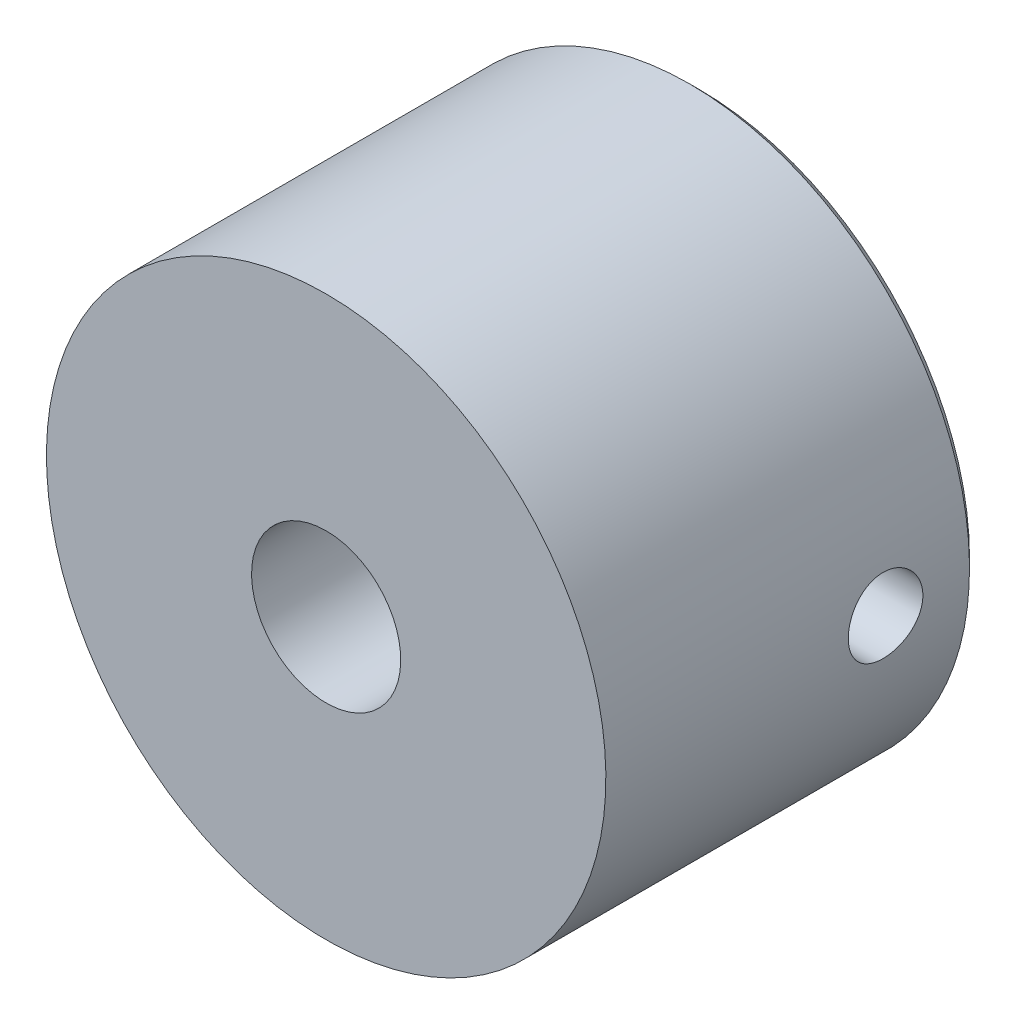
ISO-10303-21;
HEADER;
FILE_DESCRIPTION(('STEP AP214'),'2;1');
FILE_NAME('part.step','',(''),(''),'','','');
FILE_SCHEMA(('AUTOMOTIVE_DESIGN { 1 0 10303 214 1 1 1 1 }'));
ENDSEC;
DATA;
#1=APPLICATION_CONTEXT('core data for automotive mechanical design processes');
#2=APPLICATION_PROTOCOL_DEFINITION('international standard','automotive_design',2000,#1);
#3=PRODUCT_CONTEXT('',#1,'mechanical');
#4=PRODUCT('Part','Part','',(#3));
#5=PRODUCT_RELATED_PRODUCT_CATEGORY('part','',(#4));
#6=PRODUCT_DEFINITION_FORMATION('','',#4);
#7=PRODUCT_DEFINITION_CONTEXT('part definition',#1,'design');
#8=PRODUCT_DEFINITION('design','',#6,#7);
#9=PRODUCT_DEFINITION_SHAPE('','',#8);
#10=(LENGTH_UNIT() NAMED_UNIT(*) SI_UNIT(.MILLI.,.METRE.));
#11=(NAMED_UNIT(*) PLANE_ANGLE_UNIT() SI_UNIT($,.RADIAN.));
#12=(NAMED_UNIT(*) SI_UNIT($,.STERADIAN.) SOLID_ANGLE_UNIT());
#13=UNCERTAINTY_MEASURE_WITH_UNIT(LENGTH_MEASURE(1.E-05),#10,'distance_accuracy_value','');
#14=(GEOMETRIC_REPRESENTATION_CONTEXT(3) GLOBAL_UNCERTAINTY_ASSIGNED_CONTEXT((#13)) GLOBAL_UNIT_ASSIGNED_CONTEXT((#10,
#11,#12)) REPRESENTATION_CONTEXT('',''));
#15=CARTESIAN_POINT('',(0.,0.,0.));
#16=DIRECTION('',(0.,0.,1.));
#17=DIRECTION('',(1.,0.,0.));
#18=AXIS2_PLACEMENT_3D('',#15,#16,#17);
#19=CARTESIAN_POINT('',(0.,0.,20.));
#20=DIRECTION('',(0.,0.,1.));
#21=DIRECTION('',(0.,1.,0.));
#22=AXIS2_PLACEMENT_3D('',#19,#20,#21);
#23=PLANE('',#22);
#24=CARTESIAN_POINT('',(0.,0.,20.));
#25=DIRECTION('',(0.,0.,1.));
#26=DIRECTION('',(0.,1.,0.));
#27=AXIS2_PLACEMENT_3D('',#24,#25,#26);
#28=CIRCLE('',#27,15.);
#29=CARTESIAN_POINT('',(0.,15.,20.));
#30=VERTEX_POINT('',#29);
#31=EDGE_CURVE('E23',#30,#30,#28,.T.);
#32=ORIENTED_EDGE('',*,*,#31,.T.);
#33=EDGE_LOOP('',(#32));
#34=FACE_BOUND('',#33,.T.);
#35=CARTESIAN_POINT('',(0.,0.,20.));
#36=DIRECTION('',(0.,0.,1.));
#37=DIRECTION('',(0.,1.,0.));
#38=AXIS2_PLACEMENT_3D('',#35,#36,#37);
#39=CIRCLE('',#38,4.);
#40=CARTESIAN_POINT('',(0.,4.,20.));
#41=VERTEX_POINT('',#40);
#42=EDGE_CURVE('E27',#41,#41,#39,.T.);
#43=ORIENTED_EDGE('',*,*,#42,.F.);
#44=EDGE_LOOP('',(#43));
#45=FACE_BOUND('',#44,.T.);
#46=ADVANCED_FACE('F12',(#34,#45),#23,.T.);
#47=CARTESIAN_POINT('',(0.,0.,0.));
#48=DIRECTION('',(0.,0.,1.));
#49=DIRECTION('',(0.,1.,0.));
#50=AXIS2_PLACEMENT_3D('',#47,#48,#49);
#51=PLANE('',#50);
#52=CARTESIAN_POINT('',(0.,0.,0.));
#53=DIRECTION('',(0.,0.,1.));
#54=DIRECTION('',(0.,1.,0.));
#55=AXIS2_PLACEMENT_3D('',#52,#53,#54);
#56=CIRCLE('',#55,14.5);
#57=CARTESIAN_POINT('',(0.,14.5,0.));
#58=VERTEX_POINT('',#57);
#59=EDGE_CURVE('E8',#58,#58,#56,.F.);
#60=ORIENTED_EDGE('',*,*,#59,.T.);
#61=EDGE_LOOP('',(#60));
#62=FACE_BOUND('',#61,.T.);
#63=CARTESIAN_POINT('',(0.,0.,0.));
#64=DIRECTION('',(0.,0.,1.));
#65=DIRECTION('',(0.,1.,0.));
#66=AXIS2_PLACEMENT_3D('',#63,#64,#65);
#67=CIRCLE('',#66,4.);
#68=CARTESIAN_POINT('',(0.,4.,0.));
#69=VERTEX_POINT('',#68);
#70=EDGE_CURVE('E32',#69,#69,#67,.T.);
#71=ORIENTED_EDGE('',*,*,#70,.T.);
#72=EDGE_LOOP('',(#71));
#73=FACE_BOUND('',#72,.T.);
#74=ADVANCED_FACE('F64',(#62,#73),#51,.F.);
#75=CARTESIAN_POINT('',(0.,0.,20.));
#76=DIRECTION('',(0.,0.,-1.));
#77=DIRECTION('',(0.,-1.,0.));
#78=AXIS2_PLACEMENT_3D('',#75,#76,#77);
#79=CYLINDRICAL_SURFACE('',#78,15.);
#80=CARTESIAN_POINT('',(15.,0.,7.));
#81=CARTESIAN_POINT('',(14.9999983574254,-0.111808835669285,6.99999529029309));
#82=CARTESIAN_POINT('',(14.9987367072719,-0.223685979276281,6.99059246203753));
#83=CARTESIAN_POINT('',(14.993825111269,-0.444322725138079,6.95323365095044));
#84=CARTESIAN_POINT('',(14.9901727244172,-0.553079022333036,6.92525870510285));
#85=CARTESIAN_POINT('',(14.9808907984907,-0.764248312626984,6.85159828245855));
#86=CARTESIAN_POINT('',(14.9752626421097,-0.866665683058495,6.80592518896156));
#87=CARTESIAN_POINT('',(14.9626538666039,-1.0623638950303,6.69819308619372));
#88=CARTESIAN_POINT('',(14.9556734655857,-1.15564620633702,6.63613671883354));
#89=CARTESIAN_POINT('',(14.9410899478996,-1.33102582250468,6.49698673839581));
#90=CARTESIAN_POINT('',(14.9334835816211,-1.41305798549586,6.41981135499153));
#91=CARTESIAN_POINT('',(14.9185313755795,-1.56304735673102,6.25278981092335));
#92=CARTESIAN_POINT('',(14.9111855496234,-1.63100381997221,6.16294298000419));
#93=CARTESIAN_POINT('',(14.8975543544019,-1.75115902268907,5.97270087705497));
#94=CARTESIAN_POINT('',(14.8912731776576,-1.80329607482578,5.87226631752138));
#95=CARTESIAN_POINT('',(14.8805258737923,-1.8899384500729,5.66396893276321));
#96=CARTESIAN_POINT('',(14.8760596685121,-1.92444453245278,5.55610642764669));
#97=CARTESIAN_POINT('',(14.8694793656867,-1.97464606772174,5.33669418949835));
#98=CARTESIAN_POINT('',(14.8673514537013,-1.99045204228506,5.22517016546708));
#99=CARTESIAN_POINT('',(14.8656465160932,-2.00314680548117,5.00103382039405));
#100=CARTESIAN_POINT('',(14.866069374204,-2.00003645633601,4.8884215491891));
#101=CARTESIAN_POINT('',(14.8694055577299,-1.97507745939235,4.66607886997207));
#102=CARTESIAN_POINT('',(14.8723026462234,-1.95335097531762,4.5563344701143));
#103=CARTESIAN_POINT('',(14.8802355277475,-1.89196724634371,4.34206316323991));
#104=CARTESIAN_POINT('',(14.8852713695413,-1.85230959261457,4.23753637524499));
#105=CARTESIAN_POINT('',(14.8969326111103,-1.75605929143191,4.0362903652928));
#106=CARTESIAN_POINT('',(14.903562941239,-1.69941397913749,3.93959662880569));
#107=CARTESIAN_POINT('',(14.9176623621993,-1.57083393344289,3.75704091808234));
#108=CARTESIAN_POINT('',(14.9251314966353,-1.49889840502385,3.67117950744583));
#109=CARTESIAN_POINT('',(14.9401389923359,-1.34110490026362,3.5120169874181));
#110=CARTESIAN_POINT('',(14.947677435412,-1.25514170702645,3.43882015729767));
#111=CARTESIAN_POINT('',(14.9619192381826,-1.07209417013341,3.30787795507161));
#112=CARTESIAN_POINT('',(14.9686225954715,-0.975009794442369,3.25013262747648));
#113=CARTESIAN_POINT('',(14.9804439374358,-0.77239221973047,3.15173088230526));
#114=CARTESIAN_POINT('',(14.9855612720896,-0.666855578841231,3.11108146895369));
#115=CARTESIAN_POINT('',(14.9936282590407,-0.450370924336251,3.04811068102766));
#116=CARTESIAN_POINT('',(14.9965780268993,-0.339423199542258,3.02578832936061));
#117=CARTESIAN_POINT('',(14.9999624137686,-0.116166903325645,3.00024156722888));
#118=CARTESIAN_POINT('',(15.0004159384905,-0.00387503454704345,2.99687359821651));
#119=CARTESIAN_POINT('',(14.9988079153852,0.219671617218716,3.00895166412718));
#120=CARTESIAN_POINT('',(14.996746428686,0.330926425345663,3.02439724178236));
#121=CARTESIAN_POINT('',(14.990351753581,0.548813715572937,3.07354465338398));
#122=CARTESIAN_POINT('',(14.9860271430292,0.655462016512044,3.10717756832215));
#123=CARTESIAN_POINT('',(14.9755900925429,0.861605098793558,3.19167296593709));
#124=CARTESIAN_POINT('',(14.9694775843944,0.961099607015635,3.24253610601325));
#125=CARTESIAN_POINT('',(14.9560983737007,1.15074887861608,3.36039215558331));
#126=CARTESIAN_POINT('',(14.9488251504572,1.2408458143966,3.42747736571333));
#127=CARTESIAN_POINT('',(14.9339572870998,1.4085529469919,3.57574332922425));
#128=CARTESIAN_POINT('',(14.9263626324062,1.48616257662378,3.65692472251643));
#129=CARTESIAN_POINT('',(14.9116490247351,1.62720549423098,3.83171314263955));
#130=CARTESIAN_POINT('',(14.904533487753,1.69054327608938,3.92539756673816));
#131=CARTESIAN_POINT('',(14.8916413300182,1.80058351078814,4.12215941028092));
#132=CARTESIAN_POINT('',(14.8858646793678,1.84728633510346,4.22523661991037));
#133=CARTESIAN_POINT('',(14.8763281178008,1.92257836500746,4.43755724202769));
#134=CARTESIAN_POINT('',(14.872562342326,1.95122028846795,4.5467816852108));
#135=CARTESIAN_POINT('',(14.8674574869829,1.98974667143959,4.76854363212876));
#136=CARTESIAN_POINT('',(14.8661182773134,1.99963213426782,4.88108095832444));
#137=CARTESIAN_POINT('',(14.8660223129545,2.00034485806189,5.10532349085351));
#138=CARTESIAN_POINT('',(14.8672452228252,1.99132219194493,5.21702824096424));
#139=CARTESIAN_POINT('',(14.872091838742,1.95479376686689,5.43731787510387));
#140=CARTESIAN_POINT('',(14.8757155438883,1.92728801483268,5.54590276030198));
#141=CARTESIAN_POINT('',(14.8849489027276,1.85462310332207,5.75684368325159));
#142=CARTESIAN_POINT('',(14.890557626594,1.80947220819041,5.85920261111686));
#143=CARTESIAN_POINT('',(14.9031304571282,1.70281342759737,6.05491588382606));
#144=CARTESIAN_POINT('',(14.910094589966,1.64130522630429,6.14827005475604));
#145=CARTESIAN_POINT('',(14.9246596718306,1.50312448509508,6.32408964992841));
#146=CARTESIAN_POINT('',(14.9322650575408,1.42634027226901,6.40646694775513));
#147=CARTESIAN_POINT('',(14.9472171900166,1.26002169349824,6.55722321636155));
#148=CARTESIAN_POINT('',(14.9545638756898,1.17048434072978,6.62559889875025));
#149=CARTESIAN_POINT('',(14.9682063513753,0.980752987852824,6.74666713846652));
#150=CARTESIAN_POINT('',(14.9744974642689,0.880514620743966,6.79929066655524));
#151=CARTESIAN_POINT('',(14.9852732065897,0.672592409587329,6.88688059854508));
#152=CARTESIAN_POINT('',(14.9897597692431,0.564916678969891,6.92186590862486));
#153=CARTESIAN_POINT('',(14.9953572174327,0.38058840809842,6.96494800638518));
#154=CARTESIAN_POINT('',(14.9970896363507,0.30509108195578,6.97807324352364));
#155=CARTESIAN_POINT('',(14.9994115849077,0.153073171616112,6.99560081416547));
#156=CARTESIAN_POINT('',(15.000001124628,0.0765525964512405,7.0000032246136));
#157=CARTESIAN_POINT('',(15.,0.,7.));
#158=B_SPLINE_CURVE_WITH_KNOTS('',3,(#80,#81,#82,#83,#84,#85,#86,#87,#88,#89,#90,#91,#92,#93,
#94,#95,#96,#97,#98,#99,#100,#101,#102,#103,#104,#105,#106,#107,#108,#109,#110,#111,#112,#113,
#114,#115,#116,#117,#118,#119,#120,#121,#122,#123,#124,#125,#126,#127,#128,#129,#130,#131,#132,
#133,#134,#135,#136,#137,#138,#139,#140,#141,#142,#143,#144,#145,#146,#147,#148,#149,#150,#151,
#152,#153,#154,#155,#156,#157),.UNSPECIFIED.,.T.,.F.,(4,2,2,2,2,2,2,2,2,2,2,2,2,2,2,2,2,2,2,2,2,
2,2,2,2,2,2,2,2,2,2,2,2,2,2,2,2,2,4),(0.,0.335146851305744,0.670636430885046,1.00589169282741,
1.34109292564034,1.67815978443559,2.01524447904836,2.35362721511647,2.69199537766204,
3.02835355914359,3.3646964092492,3.69884885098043,4.0330089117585,4.36821583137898,
4.70344018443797,5.04130544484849,5.37917167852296,5.71717620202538,6.05516270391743,
6.3905858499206,6.72600084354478,7.06015363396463,7.39431917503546,7.73043274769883,
8.06656158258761,8.40487704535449,8.74318495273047,9.08050074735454,9.41779849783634,
9.75242927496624,10.0870599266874,10.4215340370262,10.756014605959,11.0930366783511,
11.4301378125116,11.7686952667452,12.1068890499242,12.3363573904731,12.5658237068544),.UNSPECIFIED.);
#159=CARTESIAN_POINT('',(15.,0.,7.));
#160=VERTEX_POINT('',#159);
#161=EDGE_CURVE('E35',#160,#160,#158,.T.);
#162=ORIENTED_EDGE('',*,*,#161,.F.);
#163=EDGE_LOOP('',(#162));
#164=FACE_BOUND('',#163,.T.);
#165=CARTESIAN_POINT('',(0.,0.,0.5));
#166=DIRECTION('',(0.,0.,1.));
#167=DIRECTION('',(0.,1.,0.));
#168=AXIS2_PLACEMENT_3D('',#165,#166,#167);
#169=CIRCLE('',#168,15.);
#170=CARTESIAN_POINT('',(0.,15.,0.5));
#171=VERTEX_POINT('',#170);
#172=EDGE_CURVE('E19',#171,#171,#169,.T.);
#173=ORIENTED_EDGE('',*,*,#172,.T.);
#174=EDGE_LOOP('',(#173));
#175=FACE_BOUND('',#174,.T.);
#176=ORIENTED_EDGE('',*,*,#31,.F.);
#177=EDGE_LOOP('',(#176));
#178=FACE_BOUND('',#177,.T.);
#179=ADVANCED_FACE('F14',(#164,#175,#178),#79,.T.);
#180=CARTESIAN_POINT('',(0.,0.,20.));
#181=DIRECTION('',(0.,0.,-1.));
#182=DIRECTION('',(0.,-1.,0.));
#183=AXIS2_PLACEMENT_3D('',#180,#181,#182);
#184=CYLINDRICAL_SURFACE('',#183,4.);
#185=CARTESIAN_POINT('',(4.,0.,7.));
#186=CARTESIAN_POINT('',(3.99999426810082,-0.105143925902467,6.99999339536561));
#187=CARTESIAN_POINT('',(3.99580982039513,-0.210413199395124,6.99165985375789));
#188=CARTESIAN_POINT('',(3.97948312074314,-0.417840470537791,6.95869423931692));
#189=CARTESIAN_POINT('',(3.9673257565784,-0.519992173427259,6.93403121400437));
#190=CARTESIAN_POINT('',(3.93632558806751,-0.717867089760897,6.86961238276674));
#191=CARTESIAN_POINT('',(3.91750878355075,-0.813613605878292,6.82991523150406));
#192=CARTESIAN_POINT('',(3.87491553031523,-0.996945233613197,6.73685875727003));
#193=CARTESIAN_POINT('',(3.85113947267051,-1.08453098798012,6.68350051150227));
#194=CARTESIAN_POINT('',(3.79912516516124,-1.25501563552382,6.56096550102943));
#195=CARTESIAN_POINT('',(3.77070398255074,-1.33731042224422,6.49102704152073));
#196=CARTESIAN_POINT('',(3.71319940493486,-1.48955888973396,6.33895704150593));
#197=CARTESIAN_POINT('',(3.6841155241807,-1.55950316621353,6.25681629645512));
#198=CARTESIAN_POINT('',(3.62597902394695,-1.69050400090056,6.07503330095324));
#199=CARTESIAN_POINT('',(3.59710373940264,-1.75045067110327,5.97452780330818));
#200=CARTESIAN_POINT('',(3.54571957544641,-1.85233645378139,5.76326532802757));
#201=CARTESIAN_POINT('',(3.5232061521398,-1.89428842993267,5.6525157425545));
#202=CARTESIAN_POINT('',(3.48915734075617,-1.95626488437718,5.43066978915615));
#203=CARTESIAN_POINT('',(3.47704543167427,-1.97745171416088,5.31999109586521));
#204=CARTESIAN_POINT('',(3.46363779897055,-2.00085398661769,5.09604232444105));
#205=CARTESIAN_POINT('',(3.46233138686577,-2.00308817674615,4.98277491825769));
#206=CARTESIAN_POINT('',(3.47021860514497,-1.98937457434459,4.77142795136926));
#207=CARTESIAN_POINT('',(3.47817527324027,-1.97556911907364,4.6731519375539));
#208=CARTESIAN_POINT('',(3.50152457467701,-1.93387969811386,4.48055618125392));
#209=CARTESIAN_POINT('',(3.51691957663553,-1.9059912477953,4.38623770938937));
#210=CARTESIAN_POINT('',(3.55374952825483,-1.83641956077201,4.20154173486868));
#211=CARTESIAN_POINT('',(3.57531681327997,-1.79443013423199,4.11130720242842));
#212=CARTESIAN_POINT('',(3.62206808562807,-1.698083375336,3.93873141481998));
#213=CARTESIAN_POINT('',(3.64725369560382,-1.64372048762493,3.85639372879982));
#214=CARTESIAN_POINT('',(3.70226315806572,-1.51613210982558,3.69095749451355));
#215=CARTESIAN_POINT('',(3.73227020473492,-1.44138891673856,3.60908625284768));
#216=CARTESIAN_POINT('',(3.79095246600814,-1.27911115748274,3.4585291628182));
#217=CARTESIAN_POINT('',(3.81962703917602,-1.19157051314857,3.38984961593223));
#218=CARTESIAN_POINT('',(3.87403974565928,-1.00103301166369,3.26462867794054));
#219=CARTESIAN_POINT('',(3.89957968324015,-0.897507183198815,3.20879905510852));
#220=CARTESIAN_POINT('',(3.94315762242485,-0.680932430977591,3.11580594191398));
#221=CARTESIAN_POINT('',(3.96120157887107,-0.56789115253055,3.07862762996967));
#222=CARTESIAN_POINT('',(3.98648667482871,-0.345532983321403,3.02704919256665));
#223=CARTESIAN_POINT('',(3.9944987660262,-0.236683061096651,3.01101752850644));
#224=CARTESIAN_POINT('',(4.00146026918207,-0.0175591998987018,2.99707053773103));
#225=CARTESIAN_POINT('',(4.00041397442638,0.0927140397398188,2.99914662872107));
#226=CARTESIAN_POINT('',(3.9898238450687,0.302465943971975,3.02041337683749));
#227=CARTESIAN_POINT('',(3.98094491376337,0.402118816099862,3.03826506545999));
#228=CARTESIAN_POINT('',(3.9564434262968,0.596813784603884,3.08847614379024));
#229=CARTESIAN_POINT('',(3.94082012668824,0.691855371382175,3.12083713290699));
#230=CARTESIAN_POINT('',(3.90368502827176,0.877777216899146,3.19999693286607));
#231=CARTESIAN_POINT('',(3.88201763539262,0.968460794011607,3.24718210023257));
#232=CARTESIAN_POINT('',(3.83487948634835,1.14092272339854,3.35421507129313));
#233=CARTESIAN_POINT('',(3.80940711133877,1.22269725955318,3.41406826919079));
#234=CARTESIAN_POINT('',(3.75416442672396,1.38353537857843,3.55152085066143));
#235=CARTESIAN_POINT('',(3.72421769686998,1.46154415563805,3.63028573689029));
#236=CARTESIAN_POINT('',(3.6652478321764,1.60371264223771,3.79985030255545));
#237=CARTESIAN_POINT('',(3.63622534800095,1.66786277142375,3.89065823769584));
#238=CARTESIAN_POINT('',(3.58102384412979,1.78341582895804,4.08728730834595));
#239=CARTESIAN_POINT('',(3.55505059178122,1.8340509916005,4.19362253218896));
#240=CARTESIAN_POINT('',(3.51148144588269,1.91616565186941,4.41502013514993));
#241=CARTESIAN_POINT('',(3.493874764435,1.94766983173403,4.53007105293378));
#242=CARTESIAN_POINT('',(3.47123002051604,1.98772337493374,4.75382044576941));
#243=CARTESIAN_POINT('',(3.4651476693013,1.9981859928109,4.86206850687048));
#244=CARTESIAN_POINT('',(3.46330709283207,2.0013783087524,5.07889413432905));
#245=CARTESIAN_POINT('',(3.4675443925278,1.99411569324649,5.18747153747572));
#246=CARTESIAN_POINT('',(3.48475724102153,1.96385225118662,5.39096700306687));
#247=CARTESIAN_POINT('',(3.49686188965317,1.94241662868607,5.48620094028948));
#248=CARTESIAN_POINT('',(3.52742032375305,1.88635071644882,5.67161623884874));
#249=CARTESIAN_POINT('',(3.54587615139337,1.85171618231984,5.76179596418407));
#250=CARTESIAN_POINT('',(3.58857060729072,1.76763149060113,5.94124970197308));
#251=CARTESIAN_POINT('',(3.61311444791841,1.7173422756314,6.03005580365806));
#252=CARTESIAN_POINT('',(3.66470663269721,1.60430194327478,6.19854907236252));
#253=CARTESIAN_POINT('',(3.69175627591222,1.54154434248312,6.27823146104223));
#254=CARTESIAN_POINT('',(3.74924646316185,1.39640665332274,6.43628396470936));
#255=CARTESIAN_POINT('',(3.77969966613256,1.31256884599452,6.51331820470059));
#256=CARTESIAN_POINT('',(3.83755504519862,1.13230961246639,6.65252596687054));
#257=CARTESIAN_POINT('',(3.86495557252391,1.03588144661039,6.71469147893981));
#258=CARTESIAN_POINT('',(3.91396019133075,0.83186319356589,6.82247272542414));
#259=CARTESIAN_POINT('',(3.93552192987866,0.72419900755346,6.86796833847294));
#260=CARTESIAN_POINT('',(3.97002682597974,0.501484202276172,6.93961633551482));
#261=CARTESIAN_POINT('',(3.98299446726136,0.386455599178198,6.96582369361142));
#262=CARTESIAN_POINT('',(3.99390923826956,0.225203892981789,6.98779482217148));
#263=CARTESIAN_POINT('',(3.99618730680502,0.180323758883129,6.99236528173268));
#264=CARTESIAN_POINT('',(3.99923393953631,0.0903034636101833,6.99846933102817));
#265=CARTESIAN_POINT('',(4.00000246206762,0.0451632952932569,7.00000283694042));
#266=CARTESIAN_POINT('',(4.,0.,7.));
#267=B_SPLINE_CURVE_WITH_KNOTS('',3,(#185,#186,#187,#188,#189,#190,#191,#192,#193,#194,#195,
#196,#197,#198,#199,#200,#201,#202,#203,#204,#205,#206,#207,#208,#209,#210,#211,#212,#213,#214,
#215,#216,#217,#218,#219,#220,#221,#222,#223,#224,#225,#226,#227,#228,#229,#230,#231,#232,#233,
#234,#235,#236,#237,#238,#239,#240,#241,#242,#243,#244,#245,#246,#247,#248,#249,#250,#251,#252,
#253,#254,#255,#256,#257,#258,#259,#260,#261,#262,#263,#264,#265,#266),.UNSPECIFIED.,.T.,.F.,(4,
2,2,2,2,2,2,2,2,2,2,2,2,2,2,2,2,2,2,2,2,2,2,2,2,2,2,2,2,2,2,2,2,2,2,2,2,2,2,2,4),(0.,
0.315248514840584,0.631096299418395,0.945724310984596,1.26032752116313,1.59396351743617,
1.92785247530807,2.28763452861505,2.64715895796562,2.98516024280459,3.32282714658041,
3.62011424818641,3.91749607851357,4.22180480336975,4.52625042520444,4.86929882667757,
5.21251069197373,5.57166044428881,5.93052433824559,6.25966580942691,6.58865129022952,
6.89213813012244,7.19565843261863,7.50785712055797,7.82018901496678,8.16319221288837,
8.50643177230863,8.86629364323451,9.22569023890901,9.55058615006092,9.87534119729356,
10.1691586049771,10.463070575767,10.7767291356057,11.0905512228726,11.4425048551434,
11.7946476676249,12.1492802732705,12.502898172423,12.6383056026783,12.7737167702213),.UNSPECIFIED.);
#268=CARTESIAN_POINT('',(4.,0.,7.));
#269=VERTEX_POINT('',#268);
#270=EDGE_CURVE('E43',#269,#269,#267,.T.);
#271=ORIENTED_EDGE('',*,*,#270,.T.);
#272=EDGE_LOOP('',(#271));
#273=FACE_BOUND('',#272,.T.);
#274=ORIENTED_EDGE('',*,*,#42,.T.);
#275=EDGE_LOOP('',(#274));
#276=FACE_BOUND('',#275,.T.);
#277=ORIENTED_EDGE('',*,*,#70,.F.);
#278=EDGE_LOOP('',(#277));
#279=FACE_BOUND('',#278,.T.);
#280=ADVANCED_FACE('F59',(#273,#276,#279),#184,.F.);
#281=CARTESIAN_POINT('',(0.,0.,0.5));
#282=DIRECTION('',(0.,0.,1.));
#283=DIRECTION('',(0.,1.,0.));
#284=AXIS2_PLACEMENT_3D('',#281,#282,#283);
#285=CONICAL_SURFACE('',#284,15.,0.785398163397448);
#286=ORIENTED_EDGE('',*,*,#59,.F.);
#287=EDGE_LOOP('',(#286));
#288=FACE_BOUND('',#287,.T.);
#289=ORIENTED_EDGE('',*,*,#172,.F.);
#290=EDGE_LOOP('',(#289));
#291=FACE_BOUND('',#290,.T.);
#292=ADVANCED_FACE('F54',(#288,#291),#285,.T.);
#293=CARTESIAN_POINT('',(15.001,0.,5.));
#294=DIRECTION('',(-1.,0.,0.));
#295=DIRECTION('',(0.,0.,1.));
#296=AXIS2_PLACEMENT_3D('',#293,#294,#295);
#297=CYLINDRICAL_SURFACE('',#296,2.);
#298=ORIENTED_EDGE('',*,*,#270,.F.);
#299=EDGE_LOOP('',(#298));
#300=FACE_BOUND('',#299,.T.);
#301=ORIENTED_EDGE('',*,*,#161,.T.);
#302=EDGE_LOOP('',(#301));
#303=FACE_BOUND('',#302,.T.);
#304=ADVANCED_FACE('F48',(#300,#303),#297,.F.);
#305=CLOSED_SHELL('',(#46,#74,#179,#280,#292,#304));
#306=MANIFOLD_SOLID_BREP('B1',#305);
#307=ADVANCED_BREP_SHAPE_REPRESENTATION('',(#18,#306),#14);
#308=SHAPE_DEFINITION_REPRESENTATION(#9,#307);
ENDSEC;
END-ISO-10303-21;
